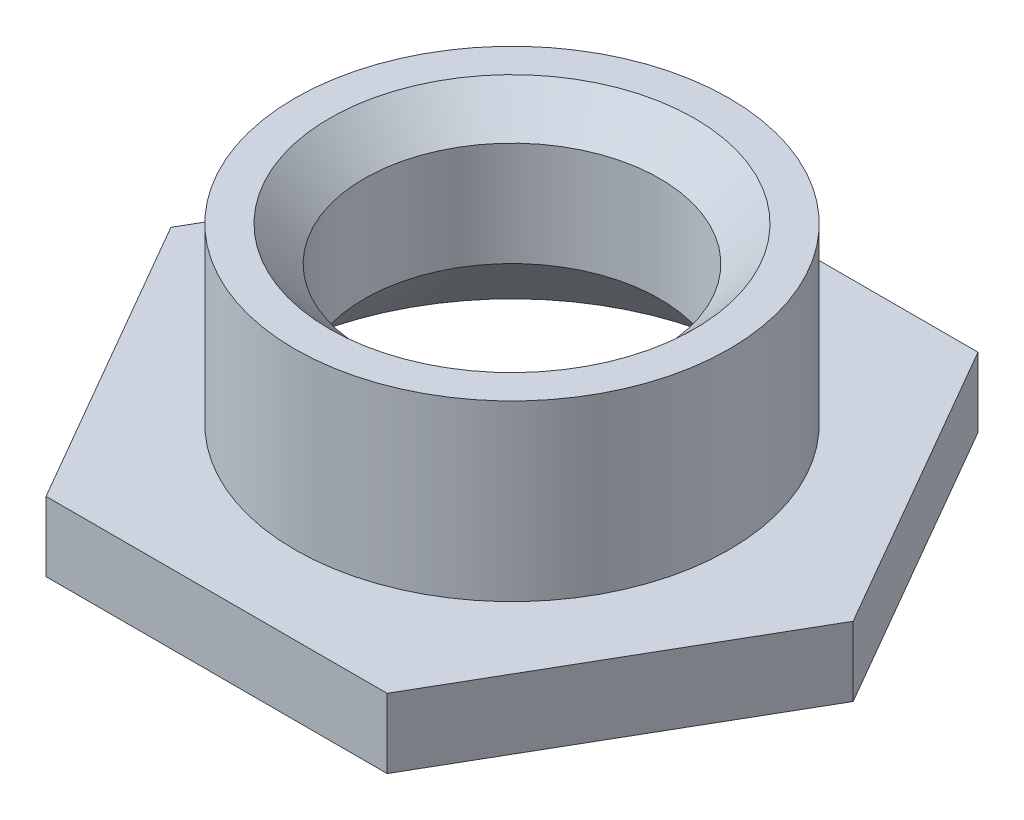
from build123d import *

# Parameters (mm, degrees)
EXTRUDE_1_DEPTH     = 2
SKETCH_2_R          = 6.25
EXTRUDE_2_DEPTH     = 5
SKETCH_3_R          = 4.25
CUT_EXTRUDE_1_DEPTH = 15.750706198
CHAMFER_1_SIZE      = 1
CHAMFER_2_SIZE      = 3


with BuildPart() as part:
    # Sketch 1 → Extrude 1 (new body)
    with BuildSketch(Plane(origin=(0, 0, 0), x_dir=(1, 0, 0), z_dir=(0, 1, 0))):
        Polygon((9.814954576, 0), (4.907477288, 8.5), (-4.907477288, 8.5), (-9.814954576, 0), (-4.907477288, -8.5), (4.907477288, -8.5), align=None)
    extrude(amount=EXTRUDE_1_DEPTH)

    # Sketch 2 → Extrude 2 (add)
    with BuildSketch(Plane(origin=(0, 2, 0), x_dir=(1, 0, 0), z_dir=(0, 1, 0))):
        with Locations(Location((0, 0, 0), (0, 0, 270))):
            Circle(SKETCH_2_R)
    extrude(amount=EXTRUDE_2_DEPTH)

    # Sketch 3 → Cut-Extrude 1 (cut, through all)
    with BuildSketch(Plane(origin=(0, 7, 0), x_dir=(1, 0, 0), z_dir=(0, 1, 0))):
        with Locations(Location((0, 0, 0), (0, 0, 270))):
            Circle(SKETCH_3_R)
    extrude(amount=-CUT_EXTRUDE_1_DEPTH, mode=Mode.SUBTRACT)

    # Chamfer 1
    chamfer_1_edges = [part.edges().sort_by_distance(p)[0] for p in [
        (0, 7, -4.25),
    ]]
    chamfer(chamfer_1_edges, length=CHAMFER_1_SIZE)

    # Chamfer 2
    chamfer_2_edges = [part.edges().sort_by_distance(p)[0] for p in [
        (0, 0, -4.25),
    ]]
    chamfer(chamfer_2_edges, length=CHAMFER_2_SIZE)


solid = part.part
